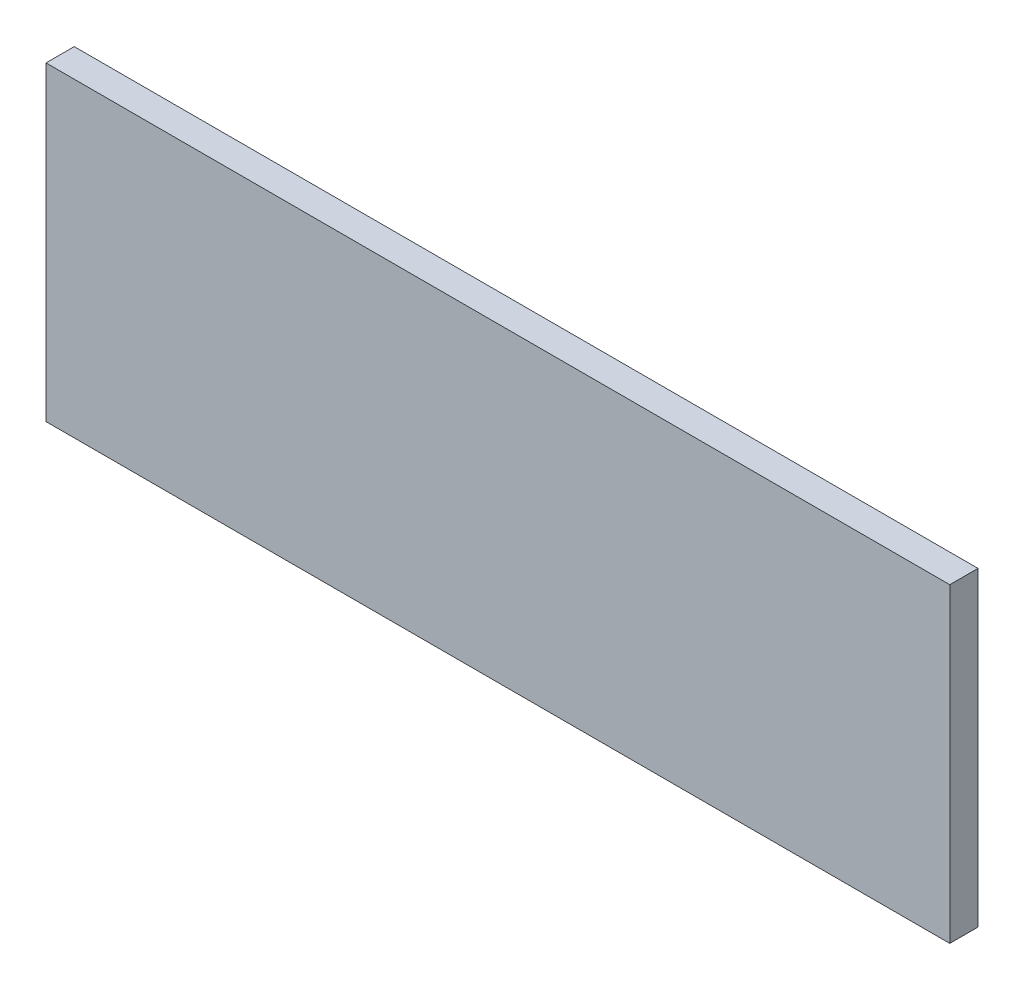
from build123d import *

# Parameters (mm, degrees)
SKETCH1_W      = 406.4
SKETCH1_H      = 139.7
EXTRUDE1_DEPTH = 12.7


with BuildPart() as part:
    # Sketch1 → Extrude1 (new body)
    with BuildSketch(Plane.XY):
        Rectangle(SKETCH1_W, SKETCH1_H)
    extrude(amount=EXTRUDE1_DEPTH)


solid = part.part
